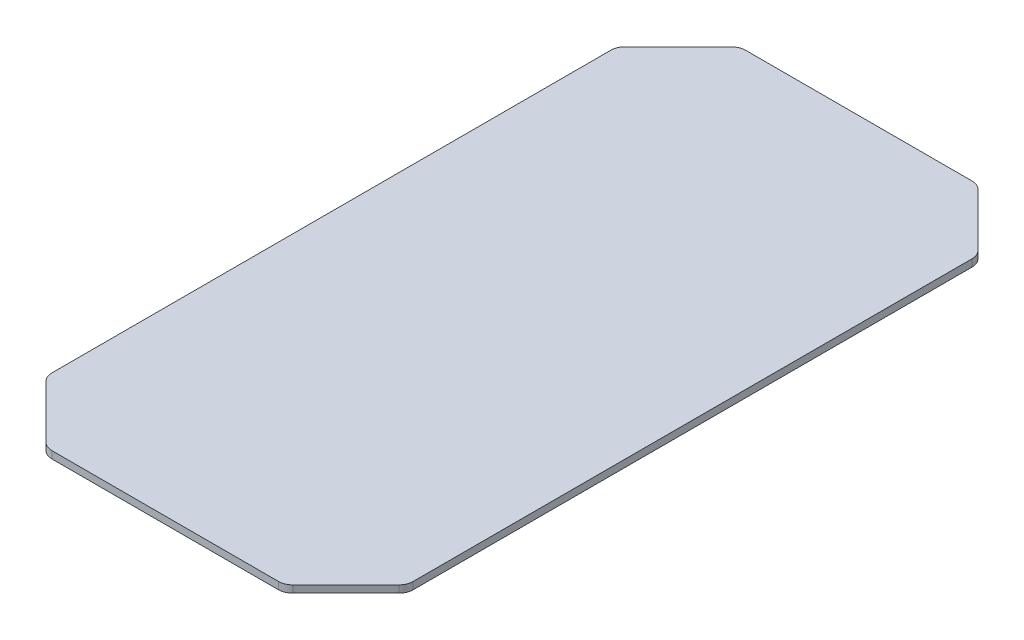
ISO-10303-21;
HEADER;
FILE_DESCRIPTION(('STEP AP214'),'2;1');
FILE_NAME('part.step','',(''),(''),'','','');
FILE_SCHEMA(('AUTOMOTIVE_DESIGN { 1 0 10303 214 1 1 1 1 }'));
ENDSEC;
DATA;
#1=APPLICATION_CONTEXT('core data for automotive mechanical design processes');
#2=APPLICATION_PROTOCOL_DEFINITION('international standard','automotive_design',2000,#1);
#3=PRODUCT_CONTEXT('',#1,'mechanical');
#4=PRODUCT('Part','Part','',(#3));
#5=PRODUCT_RELATED_PRODUCT_CATEGORY('part','',(#4));
#6=PRODUCT_DEFINITION_FORMATION('','',#4);
#7=PRODUCT_DEFINITION_CONTEXT('part definition',#1,'design');
#8=PRODUCT_DEFINITION('design','',#6,#7);
#9=PRODUCT_DEFINITION_SHAPE('','',#8);
#10=(LENGTH_UNIT() NAMED_UNIT(*) SI_UNIT(.MILLI.,.METRE.));
#11=(NAMED_UNIT(*) PLANE_ANGLE_UNIT() SI_UNIT($,.RADIAN.));
#12=(NAMED_UNIT(*) SI_UNIT($,.STERADIAN.) SOLID_ANGLE_UNIT());
#13=UNCERTAINTY_MEASURE_WITH_UNIT(LENGTH_MEASURE(1.E-05),#10,'distance_accuracy_value','');
#14=(GEOMETRIC_REPRESENTATION_CONTEXT(3) GLOBAL_UNCERTAINTY_ASSIGNED_CONTEXT((#13)) GLOBAL_UNIT_ASSIGNED_CONTEXT((#10,
#11,#12)) REPRESENTATION_CONTEXT('',''));
#15=CARTESIAN_POINT('',(0.,0.,0.));
#16=DIRECTION('',(0.,0.,1.));
#17=DIRECTION('',(1.,0.,0.));
#18=AXIS2_PLACEMENT_3D('',#15,#16,#17);
#19=CARTESIAN_POINT('',(158.75,6.35,304.8));
#20=DIRECTION('',(-1.,0.,0.));
#21=DIRECTION('',(0.,0.,1.));
#22=AXIS2_PLACEMENT_3D('',#19,#20,#21);
#23=PLANE('',#22);
#24=DIRECTION('',(0.,0.,-1.));
#25=VECTOR('',#24,1.);
#26=CARTESIAN_POINT('',(158.75,0.,304.8));
#27=LINE('',#26,#25);
#28=CARTESIAN_POINT('',(158.75,0.,245.564487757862));
#29=VERTEX_POINT('',#28);
#30=CARTESIAN_POINT('',(158.75,0.,-245.564487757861));
#31=VERTEX_POINT('',#30);
#32=EDGE_CURVE('E268',#29,#31,#27,.T.);
#33=ORIENTED_EDGE('',*,*,#32,.T.);
#34=DIRECTION('',(0.,-1.,0.));
#35=VECTOR('',#34,1.);
#36=CARTESIAN_POINT('',(158.75,6.35,-245.564487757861));
#37=LINE('',#36,#35);
#38=CARTESIAN_POINT('',(158.75,6.35,-245.564487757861));
#39=VERTEX_POINT('',#38);
#40=EDGE_CURVE('E167',#31,#39,#37,.F.);
#41=ORIENTED_EDGE('',*,*,#40,.T.);
#42=DIRECTION('',(0.,0.,-1.));
#43=VECTOR('',#42,1.);
#44=CARTESIAN_POINT('',(158.75,6.35,304.8));
#45=LINE('',#44,#43);
#46=CARTESIAN_POINT('',(158.75,6.35,245.564487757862));
#47=VERTEX_POINT('',#46);
#48=EDGE_CURVE('E151',#47,#39,#45,.T.);
#49=ORIENTED_EDGE('',*,*,#48,.F.);
#50=DIRECTION('',(0.,1.,0.));
#51=VECTOR('',#50,1.);
#52=CARTESIAN_POINT('',(158.75,0.,245.564487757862));
#53=LINE('',#52,#51);
#54=EDGE_CURVE('E164',#47,#29,#53,.F.);
#55=ORIENTED_EDGE('',*,*,#54,.T.);
#56=EDGE_LOOP('',(#33,#41,#49,#55));
#57=FACE_BOUND('',#56,.T.);
#58=ADVANCED_FACE('F32',(#57),#23,.F.);
#59=CARTESIAN_POINT('',(-158.75,6.35,-304.8));
#60=DIRECTION('',(0.,0.,1.));
#61=DIRECTION('',(1.,0.,0.));
#62=AXIS2_PLACEMENT_3D('',#59,#60,#61);
#63=PLANE('',#62);
#64=DIRECTION('',(-1.,0.,0.));
#65=VECTOR('',#64,1.);
#66=CARTESIAN_POINT('',(-158.75,6.35,-304.8));
#67=LINE('',#66,#65);
#68=CARTESIAN_POINT('',(99.5144877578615,6.35,-304.8));
#69=VERTEX_POINT('',#68);
#70=CARTESIAN_POINT('',(-99.5144877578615,6.35,-304.8));
#71=VERTEX_POINT('',#70);
#72=EDGE_CURVE('E168',#69,#71,#67,.T.);
#73=ORIENTED_EDGE('',*,*,#72,.F.);
#74=DIRECTION('',(0.,1.,0.));
#75=VECTOR('',#74,1.);
#76=CARTESIAN_POINT('',(99.5144877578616,0.,-304.8));
#77=LINE('',#76,#75);
#78=CARTESIAN_POINT('',(99.5144877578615,0.,-304.8));
#79=VERTEX_POINT('',#78);
#80=EDGE_CURVE('E211',#69,#79,#77,.F.);
#81=ORIENTED_EDGE('',*,*,#80,.T.);
#82=DIRECTION('',(-1.,0.,0.));
#83=VECTOR('',#82,1.);
#84=CARTESIAN_POINT('',(-158.75,0.,-304.8));
#85=LINE('',#84,#83);
#86=CARTESIAN_POINT('',(-99.5144877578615,0.,-304.8));
#87=VERTEX_POINT('',#86);
#88=EDGE_CURVE('E270',#79,#87,#85,.T.);
#89=ORIENTED_EDGE('',*,*,#88,.T.);
#90=DIRECTION('',(0.,-1.,0.));
#91=VECTOR('',#90,1.);
#92=CARTESIAN_POINT('',(-99.5144877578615,6.35,-304.8));
#93=LINE('',#92,#91);
#94=EDGE_CURVE('E208',#87,#71,#93,.F.);
#95=ORIENTED_EDGE('',*,*,#94,.T.);
#96=EDGE_LOOP('',(#73,#81,#89,#95));
#97=FACE_BOUND('',#96,.T.);
#98=ADVANCED_FACE('F291',(#97),#63,.F.);
#99=CARTESIAN_POINT('',(-158.75,6.35,304.8));
#100=DIRECTION('',(1.,0.,0.));
#101=DIRECTION('',(0.,0.,-1.));
#102=AXIS2_PLACEMENT_3D('',#99,#100,#101);
#103=PLANE('',#102);
#104=DIRECTION('',(0.,0.,1.));
#105=VECTOR('',#104,1.);
#106=CARTESIAN_POINT('',(-158.75,6.35,304.8));
#107=LINE('',#106,#105);
#108=CARTESIAN_POINT('',(-158.75,6.35,-245.564487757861));
#109=VERTEX_POINT('',#108);
#110=CARTESIAN_POINT('',(-158.75,6.35,245.564487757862));
#111=VERTEX_POINT('',#110);
#112=EDGE_CURVE('E257',#109,#111,#107,.T.);
#113=ORIENTED_EDGE('',*,*,#112,.F.);
#114=DIRECTION('',(0.,1.,0.));
#115=VECTOR('',#114,1.);
#116=CARTESIAN_POINT('',(-158.75,0.,-245.564487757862));
#117=LINE('',#116,#115);
#118=CARTESIAN_POINT('',(-158.75,0.,-245.564487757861));
#119=VERTEX_POINT('',#118);
#120=EDGE_CURVE('E220',#109,#119,#117,.F.);
#121=ORIENTED_EDGE('',*,*,#120,.T.);
#122=DIRECTION('',(0.,0.,1.));
#123=VECTOR('',#122,1.);
#124=CARTESIAN_POINT('',(-158.75,0.,304.8));
#125=LINE('',#124,#123);
#126=CARTESIAN_POINT('',(-158.75,0.,245.564487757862));
#127=VERTEX_POINT('',#126);
#128=EDGE_CURVE('E259',#119,#127,#125,.T.);
#129=ORIENTED_EDGE('',*,*,#128,.T.);
#130=DIRECTION('',(0.,-1.,0.));
#131=VECTOR('',#130,1.);
#132=CARTESIAN_POINT('',(-158.75,6.35,245.564487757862));
#133=LINE('',#132,#131);
#134=EDGE_CURVE('E217',#127,#111,#133,.F.);
#135=ORIENTED_EDGE('',*,*,#134,.T.);
#136=EDGE_LOOP('',(#113,#121,#129,#135));
#137=FACE_BOUND('',#136,.T.);
#138=ADVANCED_FACE('F256',(#137),#103,.F.);
#139=CARTESIAN_POINT('',(-158.75,6.35,304.8));
#140=DIRECTION('',(0.,0.,-1.));
#141=DIRECTION('',(-1.,0.,0.));
#142=AXIS2_PLACEMENT_3D('',#139,#140,#141);
#143=PLANE('',#142);
#144=DIRECTION('',(1.,0.,0.));
#145=VECTOR('',#144,1.);
#146=CARTESIAN_POINT('',(-158.75,0.,304.8));
#147=LINE('',#146,#145);
#148=CARTESIAN_POINT('',(-99.5144877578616,0.,304.8));
#149=VERTEX_POINT('',#148);
#150=CARTESIAN_POINT('',(99.5144877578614,0.,304.8));
#151=VERTEX_POINT('',#150);
#152=EDGE_CURVE('E169',#149,#151,#147,.T.);
#153=ORIENTED_EDGE('',*,*,#152,.T.);
#154=DIRECTION('',(0.,-1.,0.));
#155=VECTOR('',#154,1.);
#156=CARTESIAN_POINT('',(99.5144877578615,6.35,304.8));
#157=LINE('',#156,#155);
#158=CARTESIAN_POINT('',(99.5144877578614,6.35,304.8));
#159=VERTEX_POINT('',#158);
#160=EDGE_CURVE('E230',#151,#159,#157,.F.);
#161=ORIENTED_EDGE('',*,*,#160,.T.);
#162=DIRECTION('',(1.,0.,0.));
#163=VECTOR('',#162,1.);
#164=CARTESIAN_POINT('',(-158.75,6.35,304.8));
#165=LINE('',#164,#163);
#166=CARTESIAN_POINT('',(-99.5144877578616,6.35,304.8));
#167=VERTEX_POINT('',#166);
#168=EDGE_CURVE('E250',#167,#159,#165,.T.);
#169=ORIENTED_EDGE('',*,*,#168,.F.);
#170=DIRECTION('',(0.,1.,0.));
#171=VECTOR('',#170,1.);
#172=CARTESIAN_POINT('',(-99.5144877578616,0.,304.8));
#173=LINE('',#172,#171);
#174=EDGE_CURVE('E227',#167,#149,#173,.F.);
#175=ORIENTED_EDGE('',*,*,#174,.T.);
#176=EDGE_LOOP('',(#153,#161,#169,#175));
#177=FACE_BOUND('',#176,.T.);
#178=ADVANCED_FACE('F307',(#177),#143,.F.);
#179=CARTESIAN_POINT('',(158.75,6.35,-304.8));
#180=DIRECTION('',(0.,-1.,0.));
#181=DIRECTION('',(0.,0.,-1.));
#182=AXIS2_PLACEMENT_3D('',#179,#180,#181);
#183=PLANE('',#182);
#184=ORIENTED_EDGE('',*,*,#48,.T.);
#185=CARTESIAN_POINT('',(146.05,6.35,-245.564487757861));
#186=DIRECTION('',(0.,-1.,0.));
#187=DIRECTION('',(0.,0.,-1.));
#188=AXIS2_PLACEMENT_3D('',#185,#186,#187);
#189=CIRCLE('',#188,12.7);
#190=CARTESIAN_POINT('',(155.030256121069,6.35,-254.544743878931));
#191=VERTEX_POINT('',#190);
#192=EDGE_CURVE('E189',#39,#191,#189,.F.);
#193=ORIENTED_EDGE('',*,*,#192,.T.);
#194=DIRECTION('',(0.707106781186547,0.,0.707106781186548));
#195=VECTOR('',#194,1.);
#196=CARTESIAN_POINT('',(104.775,6.35,-304.8));
#197=LINE('',#196,#195);
#198=CARTESIAN_POINT('',(108.494743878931,6.35,-301.080256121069));
#199=VERTEX_POINT('',#198);
#200=EDGE_CURVE('E176',#191,#199,#197,.F.);
#201=ORIENTED_EDGE('',*,*,#200,.T.);
#202=CARTESIAN_POINT('',(99.5144877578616,6.35,-292.1));
#203=DIRECTION('',(0.,-1.,0.));
#204=DIRECTION('',(0.,0.,-1.));
#205=AXIS2_PLACEMENT_3D('',#202,#203,#204);
#206=CIRCLE('',#205,12.7);
#207=EDGE_CURVE('E187',#199,#69,#206,.F.);
#208=ORIENTED_EDGE('',*,*,#207,.T.);
#209=ORIENTED_EDGE('',*,*,#72,.T.);
#210=CARTESIAN_POINT('',(-99.5144877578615,6.35,-292.1));
#211=DIRECTION('',(0.,-1.,0.));
#212=DIRECTION('',(0.,0.,-1.));
#213=AXIS2_PLACEMENT_3D('',#210,#211,#212);
#214=CIRCLE('',#213,12.7);
#215=CARTESIAN_POINT('',(-108.494743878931,6.35,-301.080256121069));
#216=VERTEX_POINT('',#215);
#217=EDGE_CURVE('E185',#71,#216,#214,.F.);
#218=ORIENTED_EDGE('',*,*,#217,.T.);
#219=DIRECTION('',(0.707106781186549,0.,-0.707106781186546));
#220=VECTOR('',#219,1.);
#221=CARTESIAN_POINT('',(-158.75,6.35,-250.825));
#222=LINE('',#221,#220);
#223=CARTESIAN_POINT('',(-155.030256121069,6.35,-254.544743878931));
#224=VERTEX_POINT('',#223);
#225=EDGE_CURVE('E282',#216,#224,#222,.F.);
#226=ORIENTED_EDGE('',*,*,#225,.T.);
#227=CARTESIAN_POINT('',(-146.05,6.35,-245.564487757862));
#228=DIRECTION('',(0.,-1.,0.));
#229=DIRECTION('',(0.,0.,-1.));
#230=AXIS2_PLACEMENT_3D('',#227,#228,#229);
#231=CIRCLE('',#230,12.7);
#232=EDGE_CURVE('E157',#224,#109,#231,.F.);
#233=ORIENTED_EDGE('',*,*,#232,.T.);
#234=ORIENTED_EDGE('',*,*,#112,.T.);
#235=CARTESIAN_POINT('',(-146.05,6.35,245.564487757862));
#236=DIRECTION('',(0.,-1.,0.));
#237=DIRECTION('',(0.,0.,-1.));
#238=AXIS2_PLACEMENT_3D('',#235,#236,#237);
#239=CIRCLE('',#238,12.7);
#240=CARTESIAN_POINT('',(-155.030256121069,6.35,254.544743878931));
#241=VERTEX_POINT('',#240);
#242=EDGE_CURVE('E174',#111,#241,#239,.F.);
#243=ORIENTED_EDGE('',*,*,#242,.T.);
#244=DIRECTION('',(-0.707106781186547,0.,-0.707106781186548));
#245=VECTOR('',#244,1.);
#246=CARTESIAN_POINT('',(-104.775,6.35,304.8));
#247=LINE('',#246,#245);
#248=CARTESIAN_POINT('',(-108.494743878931,6.35,301.080256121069));
#249=VERTEX_POINT('',#248);
#250=EDGE_CURVE('E241',#241,#249,#247,.F.);
#251=ORIENTED_EDGE('',*,*,#250,.T.);
#252=CARTESIAN_POINT('',(-99.5144877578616,6.35,292.1));
#253=DIRECTION('',(0.,-1.,0.));
#254=DIRECTION('',(0.,0.,-1.));
#255=AXIS2_PLACEMENT_3D('',#252,#253,#254);
#256=CIRCLE('',#255,12.7);
#257=EDGE_CURVE('E181',#249,#167,#256,.F.);
#258=ORIENTED_EDGE('',*,*,#257,.T.);
#259=ORIENTED_EDGE('',*,*,#168,.T.);
#260=CARTESIAN_POINT('',(99.5144877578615,6.35,292.1));
#261=DIRECTION('',(0.,-1.,0.));
#262=DIRECTION('',(0.,0.,-1.));
#263=AXIS2_PLACEMENT_3D('',#260,#261,#262);
#264=CIRCLE('',#263,12.7);
#265=CARTESIAN_POINT('',(108.494743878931,6.35,301.080256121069));
#266=VERTEX_POINT('',#265);
#267=EDGE_CURVE('E158',#159,#266,#264,.F.);
#268=ORIENTED_EDGE('',*,*,#267,.T.);
#269=DIRECTION('',(-0.707106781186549,0.,0.707106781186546));
#270=VECTOR('',#269,1.);
#271=CARTESIAN_POINT('',(158.75,6.35,250.825));
#272=LINE('',#271,#270);
#273=CARTESIAN_POINT('',(155.030256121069,6.35,254.544743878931));
#274=VERTEX_POINT('',#273);
#275=EDGE_CURVE('E153',#266,#274,#272,.F.);
#276=ORIENTED_EDGE('',*,*,#275,.T.);
#277=CARTESIAN_POINT('',(146.05,6.35,245.564487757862));
#278=DIRECTION('',(0.,-1.,0.));
#279=DIRECTION('',(0.,0.,-1.));
#280=AXIS2_PLACEMENT_3D('',#277,#278,#279);
#281=CIRCLE('',#280,12.7);
#282=EDGE_CURVE('E148',#274,#47,#281,.F.);
#283=ORIENTED_EDGE('',*,*,#282,.T.);
#284=EDGE_LOOP('',(#184,#193,#201,#208,#209,#218,#226,#233,#234,#243,#251,#258,#259,#268,#276,#283));
#285=FACE_BOUND('',#284,.T.);
#286=ADVANCED_FACE('F150',(#285),#183,.F.);
#287=CARTESIAN_POINT('',(158.75,0.,-304.8));
#288=DIRECTION('',(0.,-1.,0.));
#289=DIRECTION('',(0.,0.,-1.));
#290=AXIS2_PLACEMENT_3D('',#287,#288,#289);
#291=PLANE('',#290);
#292=DIRECTION('',(-0.707106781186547,0.,-0.707106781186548));
#293=VECTOR('',#292,1.);
#294=CARTESIAN_POINT('',(131.7625,0.,-277.8125));
#295=LINE('',#294,#293);
#296=CARTESIAN_POINT('',(108.494743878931,0.,-301.080256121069));
#297=VERTEX_POINT('',#296);
#298=CARTESIAN_POINT('',(155.030256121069,0.,-254.544743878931));
#299=VERTEX_POINT('',#298);
#300=EDGE_CURVE('E276',#297,#299,#295,.F.);
#301=ORIENTED_EDGE('',*,*,#300,.T.);
#302=CARTESIAN_POINT('',(146.05,0.,-245.564487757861));
#303=DIRECTION('',(0.,-1.,0.));
#304=DIRECTION('',(0.,0.,-1.));
#305=AXIS2_PLACEMENT_3D('',#302,#303,#304);
#306=CIRCLE('',#305,12.7);
#307=EDGE_CURVE('E206',#299,#31,#306,.T.);
#308=ORIENTED_EDGE('',*,*,#307,.T.);
#309=ORIENTED_EDGE('',*,*,#32,.F.);
#310=CARTESIAN_POINT('',(146.05,0.,245.564487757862));
#311=DIRECTION('',(0.,-1.,0.));
#312=DIRECTION('',(0.,0.,-1.));
#313=AXIS2_PLACEMENT_3D('',#310,#311,#312);
#314=CIRCLE('',#313,12.7);
#315=CARTESIAN_POINT('',(155.030256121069,0.,254.544743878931));
#316=VERTEX_POINT('',#315);
#317=EDGE_CURVE('E172',#29,#316,#314,.T.);
#318=ORIENTED_EDGE('',*,*,#317,.T.);
#319=DIRECTION('',(0.707106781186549,0.,-0.707106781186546));
#320=VECTOR('',#319,1.);
#321=CARTESIAN_POINT('',(436.5625,0.,-26.9874999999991));
#322=LINE('',#321,#320);
#323=CARTESIAN_POINT('',(108.494743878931,0.,301.080256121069));
#324=VERTEX_POINT('',#323);
#325=EDGE_CURVE('E278',#316,#324,#322,.F.);
#326=ORIENTED_EDGE('',*,*,#325,.T.);
#327=CARTESIAN_POINT('',(99.5144877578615,0.,292.1));
#328=DIRECTION('',(0.,-1.,0.));
#329=DIRECTION('',(0.,0.,-1.));
#330=AXIS2_PLACEMENT_3D('',#327,#328,#329);
#331=CIRCLE('',#330,12.7);
#332=EDGE_CURVE('E199',#324,#151,#331,.T.);
#333=ORIENTED_EDGE('',*,*,#332,.T.);
#334=ORIENTED_EDGE('',*,*,#152,.F.);
#335=CARTESIAN_POINT('',(-99.5144877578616,0.,292.1));
#336=DIRECTION('',(0.,-1.,0.));
#337=DIRECTION('',(0.,0.,-1.));
#338=AXIS2_PLACEMENT_3D('',#335,#336,#337);
#339=CIRCLE('',#338,12.7);
#340=CARTESIAN_POINT('',(-108.494743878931,0.,301.080256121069));
#341=VERTEX_POINT('',#340);
#342=EDGE_CURVE('E197',#149,#341,#339,.T.);
#343=ORIENTED_EDGE('',*,*,#342,.T.);
#344=DIRECTION('',(0.707106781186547,0.,0.707106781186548));
#345=VECTOR('',#344,1.);
#346=CARTESIAN_POINT('',(-277.8125,0.,131.762499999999));
#347=LINE('',#346,#345);
#348=CARTESIAN_POINT('',(-155.030256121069,0.,254.544743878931));
#349=VERTEX_POINT('',#348);
#350=EDGE_CURVE('E238',#341,#349,#347,.F.);
#351=ORIENTED_EDGE('',*,*,#350,.T.);
#352=CARTESIAN_POINT('',(-146.05,0.,245.564487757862));
#353=DIRECTION('',(0.,-1.,0.));
#354=DIRECTION('',(0.,0.,-1.));
#355=AXIS2_PLACEMENT_3D('',#352,#353,#354);
#356=CIRCLE('',#355,12.7);
#357=EDGE_CURVE('E195',#349,#127,#356,.T.);
#358=ORIENTED_EDGE('',*,*,#357,.T.);
#359=ORIENTED_EDGE('',*,*,#128,.F.);
#360=CARTESIAN_POINT('',(-146.05,0.,-245.564487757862));
#361=DIRECTION('',(0.,-1.,0.));
#362=DIRECTION('',(0.,0.,-1.));
#363=AXIS2_PLACEMENT_3D('',#360,#361,#362);
#364=CIRCLE('',#363,12.7);
#365=CARTESIAN_POINT('',(-155.030256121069,0.,-254.544743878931));
#366=VERTEX_POINT('',#365);
#367=EDGE_CURVE('E202',#119,#366,#364,.T.);
#368=ORIENTED_EDGE('',*,*,#367,.T.);
#369=DIRECTION('',(-0.707106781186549,0.,0.707106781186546));
#370=VECTOR('',#369,1.);
#371=CARTESIAN_POINT('',(26.9875000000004,0.,-436.5625));
#372=LINE('',#371,#370);
#373=CARTESIAN_POINT('',(-108.494743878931,0.,-301.080256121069));
#374=VERTEX_POINT('',#373);
#375=EDGE_CURVE('E249',#366,#374,#372,.F.);
#376=ORIENTED_EDGE('',*,*,#375,.T.);
#377=CARTESIAN_POINT('',(-99.5144877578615,0.,-292.1));
#378=DIRECTION('',(0.,-1.,0.));
#379=DIRECTION('',(0.,0.,-1.));
#380=AXIS2_PLACEMENT_3D('',#377,#378,#379);
#381=CIRCLE('',#380,12.7);
#382=EDGE_CURVE('E47',#374,#87,#381,.T.);
#383=ORIENTED_EDGE('',*,*,#382,.T.);
#384=ORIENTED_EDGE('',*,*,#88,.F.);
#385=CARTESIAN_POINT('',(99.5144877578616,0.,-292.1));
#386=DIRECTION('',(0.,-1.,0.));
#387=DIRECTION('',(0.,0.,-1.));
#388=AXIS2_PLACEMENT_3D('',#385,#386,#387);
#389=CIRCLE('',#388,12.7);
#390=EDGE_CURVE('E55',#79,#297,#389,.T.);
#391=ORIENTED_EDGE('',*,*,#390,.T.);
#392=EDGE_LOOP('',(#301,#308,#309,#318,#326,#333,#334,#343,#351,#358,#359,#368,#376,#383,#384,#391));
#393=FACE_BOUND('',#392,.T.);
#394=ADVANCED_FACE('F245',(#393),#291,.T.);
#395=CARTESIAN_POINT('',(158.75,6.35,250.825));
#396=DIRECTION('',(-0.707106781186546,0.,-0.707106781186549));
#397=DIRECTION('',(-0.707106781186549,0.,0.707106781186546));
#398=AXIS2_PLACEMENT_3D('',#395,#396,#397);
#399=PLANE('',#398);
#400=ORIENTED_EDGE('',*,*,#325,.F.);
#401=DIRECTION('',(0.,-1.,0.));
#402=VECTOR('',#401,1.);
#403=CARTESIAN_POINT('',(155.030256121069,6.35,254.544743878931));
#404=LINE('',#403,#402);
#405=EDGE_CURVE('E225',#316,#274,#404,.F.);
#406=ORIENTED_EDGE('',*,*,#405,.T.);
#407=ORIENTED_EDGE('',*,*,#275,.F.);
#408=DIRECTION('',(0.,1.,0.));
#409=VECTOR('',#408,1.);
#410=CARTESIAN_POINT('',(108.494743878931,0.,301.080256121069));
#411=LINE('',#410,#409);
#412=EDGE_CURVE('E223',#266,#324,#411,.F.);
#413=ORIENTED_EDGE('',*,*,#412,.T.);
#414=EDGE_LOOP('',(#400,#406,#407,#413));
#415=FACE_BOUND('',#414,.T.);
#416=ADVANCED_FACE('F301',(#415),#399,.F.);
#417=CARTESIAN_POINT('',(104.775,6.35,-304.8));
#418=DIRECTION('',(-0.707106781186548,0.,0.707106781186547));
#419=DIRECTION('',(0.707106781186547,0.,0.707106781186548));
#420=AXIS2_PLACEMENT_3D('',#417,#418,#419);
#421=PLANE('',#420);
#422=ORIENTED_EDGE('',*,*,#200,.F.);
#423=DIRECTION('',(0.,1.,0.));
#424=VECTOR('',#423,1.);
#425=CARTESIAN_POINT('',(155.030256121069,0.,-254.544743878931));
#426=LINE('',#425,#424);
#427=EDGE_CURVE('E193',#191,#299,#426,.F.);
#428=ORIENTED_EDGE('',*,*,#427,.T.);
#429=ORIENTED_EDGE('',*,*,#300,.F.);
#430=DIRECTION('',(0.,-1.,0.));
#431=VECTOR('',#430,1.);
#432=CARTESIAN_POINT('',(108.494743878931,6.35,-301.080256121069));
#433=LINE('',#432,#431);
#434=EDGE_CURVE('E191',#297,#199,#433,.F.);
#435=ORIENTED_EDGE('',*,*,#434,.T.);
#436=EDGE_LOOP('',(#422,#428,#429,#435));
#437=FACE_BOUND('',#436,.T.);
#438=ADVANCED_FACE('F295',(#437),#421,.F.);
#439=CARTESIAN_POINT('',(-158.75,6.35,-250.825));
#440=DIRECTION('',(0.707106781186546,0.,0.707106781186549));
#441=DIRECTION('',(0.707106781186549,0.,-0.707106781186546));
#442=AXIS2_PLACEMENT_3D('',#439,#440,#441);
#443=PLANE('',#442);
#444=ORIENTED_EDGE('',*,*,#225,.F.);
#445=DIRECTION('',(0.,1.,0.));
#446=VECTOR('',#445,1.);
#447=CARTESIAN_POINT('',(-108.494743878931,0.,-301.080256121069));
#448=LINE('',#447,#446);
#449=EDGE_CURVE('E215',#216,#374,#448,.F.);
#450=ORIENTED_EDGE('',*,*,#449,.T.);
#451=ORIENTED_EDGE('',*,*,#375,.F.);
#452=DIRECTION('',(0.,-1.,0.));
#453=VECTOR('',#452,1.);
#454=CARTESIAN_POINT('',(-155.030256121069,6.35,-254.544743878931));
#455=LINE('',#454,#453);
#456=EDGE_CURVE('E213',#366,#224,#455,.F.);
#457=ORIENTED_EDGE('',*,*,#456,.T.);
#458=EDGE_LOOP('',(#444,#450,#451,#457));
#459=FACE_BOUND('',#458,.T.);
#460=ADVANCED_FACE('F331',(#459),#443,.F.);
#461=CARTESIAN_POINT('',(-104.775,6.35,304.8));
#462=DIRECTION('',(0.707106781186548,0.,-0.707106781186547));
#463=DIRECTION('',(-0.707106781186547,0.,-0.707106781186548));
#464=AXIS2_PLACEMENT_3D('',#461,#462,#463);
#465=PLANE('',#464);
#466=ORIENTED_EDGE('',*,*,#350,.F.);
#467=DIRECTION('',(0.,-1.,0.));
#468=VECTOR('',#467,1.);
#469=CARTESIAN_POINT('',(-108.494743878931,6.35,301.080256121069));
#470=LINE('',#469,#468);
#471=EDGE_CURVE('E11',#341,#249,#470,.F.);
#472=ORIENTED_EDGE('',*,*,#471,.T.);
#473=ORIENTED_EDGE('',*,*,#250,.F.);
#474=DIRECTION('',(0.,1.,0.));
#475=VECTOR('',#474,1.);
#476=CARTESIAN_POINT('',(-155.030256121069,0.,254.544743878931));
#477=LINE('',#476,#475);
#478=EDGE_CURVE('E40',#241,#349,#477,.F.);
#479=ORIENTED_EDGE('',*,*,#478,.T.);
#480=EDGE_LOOP('',(#466,#472,#473,#479));
#481=FACE_BOUND('',#480,.T.);
#482=ADVANCED_FACE('F237',(#481),#465,.F.);
#483=CARTESIAN_POINT('',(146.05,6.35,-245.564487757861));
#484=DIRECTION('',(0.,1.,0.));
#485=DIRECTION('',(0.,0.,1.));
#486=AXIS2_PLACEMENT_3D('',#483,#484,#485);
#487=CYLINDRICAL_SURFACE('',#486,12.7);
#488=ORIENTED_EDGE('',*,*,#307,.F.);
#489=ORIENTED_EDGE('',*,*,#427,.F.);
#490=ORIENTED_EDGE('',*,*,#192,.F.);
#491=ORIENTED_EDGE('',*,*,#40,.F.);
#492=EDGE_LOOP('',(#488,#489,#490,#491));
#493=FACE_BOUND('',#492,.T.);
#494=ADVANCED_FACE('F297',(#493),#487,.T.);
#495=CARTESIAN_POINT('',(99.5144877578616,6.35,-292.1));
#496=DIRECTION('',(0.,-1.,0.));
#497=DIRECTION('',(0.,0.,-1.));
#498=AXIS2_PLACEMENT_3D('',#495,#496,#497);
#499=CYLINDRICAL_SURFACE('',#498,12.7);
#500=ORIENTED_EDGE('',*,*,#207,.F.);
#501=ORIENTED_EDGE('',*,*,#434,.F.);
#502=ORIENTED_EDGE('',*,*,#390,.F.);
#503=ORIENTED_EDGE('',*,*,#80,.F.);
#504=EDGE_LOOP('',(#500,#501,#502,#503));
#505=FACE_BOUND('',#504,.T.);
#506=ADVANCED_FACE('F289',(#505),#499,.T.);
#507=CARTESIAN_POINT('',(-99.5144877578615,6.35,-292.1));
#508=DIRECTION('',(0.,1.,0.));
#509=DIRECTION('',(0.,0.,1.));
#510=AXIS2_PLACEMENT_3D('',#507,#508,#509);
#511=CYLINDRICAL_SURFACE('',#510,12.7);
#512=ORIENTED_EDGE('',*,*,#382,.F.);
#513=ORIENTED_EDGE('',*,*,#449,.F.);
#514=ORIENTED_EDGE('',*,*,#217,.F.);
#515=ORIENTED_EDGE('',*,*,#94,.F.);
#516=EDGE_LOOP('',(#512,#513,#514,#515));
#517=FACE_BOUND('',#516,.T.);
#518=ADVANCED_FACE('F341',(#517),#511,.T.);
#519=CARTESIAN_POINT('',(-146.05,6.35,-245.564487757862));
#520=DIRECTION('',(0.,-1.,0.));
#521=DIRECTION('',(0.,0.,-1.));
#522=AXIS2_PLACEMENT_3D('',#519,#520,#521);
#523=CYLINDRICAL_SURFACE('',#522,12.7);
#524=ORIENTED_EDGE('',*,*,#232,.F.);
#525=ORIENTED_EDGE('',*,*,#456,.F.);
#526=ORIENTED_EDGE('',*,*,#367,.F.);
#527=ORIENTED_EDGE('',*,*,#120,.F.);
#528=EDGE_LOOP('',(#524,#525,#526,#527));
#529=FACE_BOUND('',#528,.T.);
#530=ADVANCED_FACE('F344',(#529),#523,.T.);
#531=CARTESIAN_POINT('',(146.05,6.35,245.564487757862));
#532=DIRECTION('',(0.,-1.,0.));
#533=DIRECTION('',(0.,0.,-1.));
#534=AXIS2_PLACEMENT_3D('',#531,#532,#533);
#535=CYLINDRICAL_SURFACE('',#534,12.7);
#536=ORIENTED_EDGE('',*,*,#282,.F.);
#537=ORIENTED_EDGE('',*,*,#405,.F.);
#538=ORIENTED_EDGE('',*,*,#317,.F.);
#539=ORIENTED_EDGE('',*,*,#54,.F.);
#540=EDGE_LOOP('',(#536,#537,#538,#539));
#541=FACE_BOUND('',#540,.T.);
#542=ADVANCED_FACE('F171',(#541),#535,.T.);
#543=CARTESIAN_POINT('',(99.5144877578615,6.35,292.1));
#544=DIRECTION('',(0.,1.,0.));
#545=DIRECTION('',(0.,0.,1.));
#546=AXIS2_PLACEMENT_3D('',#543,#544,#545);
#547=CYLINDRICAL_SURFACE('',#546,12.7);
#548=ORIENTED_EDGE('',*,*,#332,.F.);
#549=ORIENTED_EDGE('',*,*,#412,.F.);
#550=ORIENTED_EDGE('',*,*,#267,.F.);
#551=ORIENTED_EDGE('',*,*,#160,.F.);
#552=EDGE_LOOP('',(#548,#549,#550,#551));
#553=FACE_BOUND('',#552,.T.);
#554=ADVANCED_FACE('F304',(#553),#547,.T.);
#555=CARTESIAN_POINT('',(-99.5144877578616,6.35,292.1));
#556=DIRECTION('',(0.,-1.,0.));
#557=DIRECTION('',(0.,0.,-1.));
#558=AXIS2_PLACEMENT_3D('',#555,#556,#557);
#559=CYLINDRICAL_SURFACE('',#558,12.7);
#560=ORIENTED_EDGE('',*,*,#257,.F.);
#561=ORIENTED_EDGE('',*,*,#471,.F.);
#562=ORIENTED_EDGE('',*,*,#342,.F.);
#563=ORIENTED_EDGE('',*,*,#174,.F.);
#564=EDGE_LOOP('',(#560,#561,#562,#563));
#565=FACE_BOUND('',#564,.T.);
#566=ADVANCED_FACE('F312',(#565),#559,.T.);
#567=CARTESIAN_POINT('',(-146.05,6.35,245.564487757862));
#568=DIRECTION('',(0.,1.,0.));
#569=DIRECTION('',(0.,0.,1.));
#570=AXIS2_PLACEMENT_3D('',#567,#568,#569);
#571=CYLINDRICAL_SURFACE('',#570,12.7);
#572=ORIENTED_EDGE('',*,*,#357,.F.);
#573=ORIENTED_EDGE('',*,*,#478,.F.);
#574=ORIENTED_EDGE('',*,*,#242,.F.);
#575=ORIENTED_EDGE('',*,*,#134,.F.);
#576=EDGE_LOOP('',(#572,#573,#574,#575));
#577=FACE_BOUND('',#576,.T.);
#578=ADVANCED_FACE('F34',(#577),#571,.T.);
#579=CLOSED_SHELL('',(#58,#98,#138,#178,#286,#394,#416,#438,#460,#482,#494,#506,#518,#530,#542,
#554,#566,#578));
#580=MANIFOLD_SOLID_BREP('B2',#579);
#581=ADVANCED_BREP_SHAPE_REPRESENTATION('',(#18,#580),#14);
#582=SHAPE_DEFINITION_REPRESENTATION(#9,#581);
ENDSEC;
END-ISO-10303-21;
